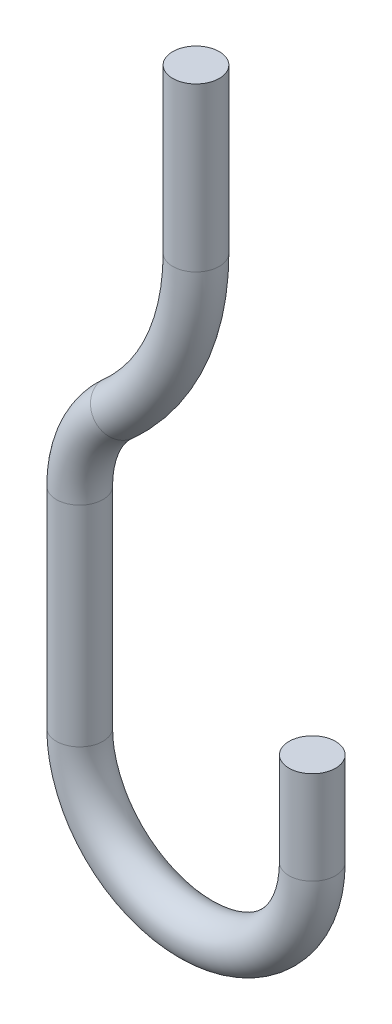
from build123d import *

# Parameters (mm, degrees)
SKETCH2_R = 5


with BuildPart() as part:
    # Sweep1: sweep along a path in Sketch1
    with BuildLine(Plane.XY) as sweep1_path:
        Line((0, 0), (0, -35))
        ThreePointArc((0, -35), (-4.356453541, -55.412414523), (-16.666666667, -72.267799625))
        ThreePointArc((-16.666666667, -72.267799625), (-22.821773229, -80.695492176), (-25, -90.901699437))
        Line((-25, -90.901699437), (-25, -135.901699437))
        ThreePointArc((-25, -135.901699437), (0, -160.901699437), (25, -135.901699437))
        Line((25, -135.901699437), (25, -115.901699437))
    # Sketch2 → Sweep1 (sweep)
    with BuildSketch(Plane(origin=(0, 0, 0), x_dir=(1, 0, 0), z_dir=(0, 1, 0))):
        Circle(SKETCH2_R)
    sweep(path=sweep1_path.line)


solid = part.part
